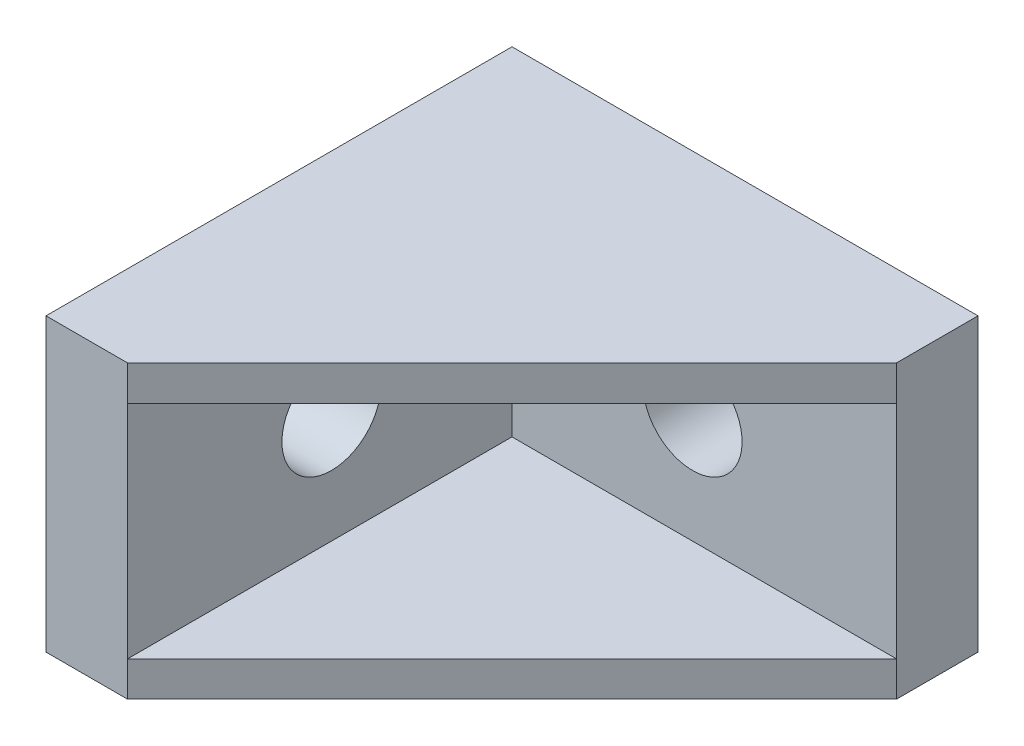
ISO-10303-21;
HEADER;
FILE_DESCRIPTION(('STEP AP214'),'2;1');
FILE_NAME('part.step','',(''),(''),'','','');
FILE_SCHEMA(('AUTOMOTIVE_DESIGN { 1 0 10303 214 1 1 1 1 }'));
ENDSEC;
DATA;
#1=APPLICATION_CONTEXT('core data for automotive mechanical design processes');
#2=APPLICATION_PROTOCOL_DEFINITION('international standard','automotive_design',2000,#1);
#3=PRODUCT_CONTEXT('',#1,'mechanical');
#4=PRODUCT('Part','Part','',(#3));
#5=PRODUCT_RELATED_PRODUCT_CATEGORY('part','',(#4));
#6=PRODUCT_DEFINITION_FORMATION('','',#4);
#7=PRODUCT_DEFINITION_CONTEXT('part definition',#1,'design');
#8=PRODUCT_DEFINITION('design','',#6,#7);
#9=PRODUCT_DEFINITION_SHAPE('','',#8);
#10=(LENGTH_UNIT() NAMED_UNIT(*) SI_UNIT(.MILLI.,.METRE.));
#11=(NAMED_UNIT(*) PLANE_ANGLE_UNIT() SI_UNIT($,.RADIAN.));
#12=(NAMED_UNIT(*) SI_UNIT($,.STERADIAN.) SOLID_ANGLE_UNIT());
#13=UNCERTAINTY_MEASURE_WITH_UNIT(LENGTH_MEASURE(1.E-05),#10,'distance_accuracy_value','');
#14=(GEOMETRIC_REPRESENTATION_CONTEXT(3) GLOBAL_UNCERTAINTY_ASSIGNED_CONTEXT((#13)) GLOBAL_UNIT_ASSIGNED_CONTEXT((#10,
#11,#12)) REPRESENTATION_CONTEXT('',''));
#15=CARTESIAN_POINT('',(0.,0.,0.));
#16=DIRECTION('',(0.,0.,1.));
#17=DIRECTION('',(1.,0.,0.));
#18=AXIS2_PLACEMENT_3D('',#15,#16,#17);
#19=CARTESIAN_POINT('',(15.6482371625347,-9.5,15.6482371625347));
#20=DIRECTION('',(0.,-1.,0.));
#21=DIRECTION('',(0.,0.,-1.));
#22=AXIS2_PLACEMENT_3D('',#19,#20,#21);
#23=PLANE('',#22);
#24=DIRECTION('',(0.707106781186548,0.,-0.707106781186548));
#25=VECTOR('',#24,1.);
#26=CARTESIAN_POINT('',(7.,-9.5,40.));
#27=LINE('',#26,#25);
#28=CARTESIAN_POINT('',(40.,-9.5,7.));
#29=VERTEX_POINT('',#28);
#30=CARTESIAN_POINT('',(7.,-9.5,40.));
#31=VERTEX_POINT('',#30);
#32=EDGE_CURVE('E101',#29,#31,#27,.F.);
#33=ORIENTED_EDGE('',*,*,#32,.F.);
#34=DIRECTION('',(-1.,0.,0.));
#35=VECTOR('',#34,1.);
#36=CARTESIAN_POINT('',(20.,-9.5,7.));
#37=LINE('',#36,#35);
#38=CARTESIAN_POINT('',(7.,-9.5,7.));
#39=VERTEX_POINT('',#38);
#40=EDGE_CURVE('E96',#29,#39,#37,.T.);
#41=ORIENTED_EDGE('',*,*,#40,.T.);
#42=DIRECTION('',(0.,0.,1.));
#43=VECTOR('',#42,1.);
#44=CARTESIAN_POINT('',(7.,-9.5,20.));
#45=LINE('',#44,#43);
#46=EDGE_CURVE('E83',#39,#31,#45,.T.);
#47=ORIENTED_EDGE('',*,*,#46,.T.);
#48=EDGE_LOOP('',(#33,#41,#47));
#49=FACE_BOUND('',#48,.T.);
#50=ADVANCED_FACE('F15',(#49),#23,.F.);
#51=CARTESIAN_POINT('',(7.,0.,20.));
#52=DIRECTION('',(-1.,0.,0.));
#53=DIRECTION('',(0.,0.,1.));
#54=AXIS2_PLACEMENT_3D('',#51,#52,#53);
#55=PLANE('',#54);
#56=CARTESIAN_POINT('',(7.,0.,22.5));
#57=DIRECTION('',(-1.,0.,0.));
#58=DIRECTION('',(0.,-1.,0.));
#59=AXIS2_PLACEMENT_3D('',#56,#57,#58);
#60=CIRCLE('',#59,4.25);
#61=CARTESIAN_POINT('',(7.,-4.25,22.5));
#62=VERTEX_POINT('',#61);
#63=EDGE_CURVE('E18',#62,#62,#60,.T.);
#64=ORIENTED_EDGE('',*,*,#63,.T.);
#65=EDGE_LOOP('',(#64));
#66=FACE_BOUND('',#65,.T.);
#67=DIRECTION('',(0.,1.,0.));
#68=VECTOR('',#67,1.);
#69=CARTESIAN_POINT('',(7.,0.,7.));
#70=LINE('',#69,#68);
#71=CARTESIAN_POINT('',(7.,9.5,7.));
#72=VERTEX_POINT('',#71);
#73=EDGE_CURVE('E86',#39,#72,#70,.T.);
#74=ORIENTED_EDGE('',*,*,#73,.T.);
#75=DIRECTION('',(0.,0.,-1.));
#76=VECTOR('',#75,1.);
#77=CARTESIAN_POINT('',(7.,9.5,15.6482371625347));
#78=LINE('',#77,#76);
#79=CARTESIAN_POINT('',(7.,9.5,40.));
#80=VERTEX_POINT('',#79);
#81=EDGE_CURVE('E77',#80,#72,#78,.T.);
#82=ORIENTED_EDGE('',*,*,#81,.F.);
#83=DIRECTION('',(0.,1.,0.));
#84=VECTOR('',#83,1.);
#85=CARTESIAN_POINT('',(7.,-9.5,40.));
#86=LINE('',#85,#84);
#87=EDGE_CURVE('E88',#31,#80,#86,.T.);
#88=ORIENTED_EDGE('',*,*,#87,.F.);
#89=ORIENTED_EDGE('',*,*,#46,.F.);
#90=EDGE_LOOP('',(#74,#82,#88,#89));
#91=FACE_BOUND('',#90,.T.);
#92=ADVANCED_FACE('F85',(#66,#91),#55,.F.);
#93=CARTESIAN_POINT('',(3.5,0.,22.5));
#94=DIRECTION('',(-1.,0.,0.));
#95=DIRECTION('',(0.,-1.,0.));
#96=AXIS2_PLACEMENT_3D('',#93,#94,#95);
#97=CYLINDRICAL_SURFACE('',#96,4.25);
#98=ORIENTED_EDGE('',*,*,#63,.F.);
#99=EDGE_LOOP('',(#98));
#100=FACE_BOUND('',#99,.T.);
#101=CARTESIAN_POINT('',(0.,0.,22.5));
#102=DIRECTION('',(-1.,0.,0.));
#103=DIRECTION('',(0.,-1.,0.));
#104=AXIS2_PLACEMENT_3D('',#101,#102,#103);
#105=CIRCLE('',#104,4.25);
#106=CARTESIAN_POINT('',(0.,-4.25,22.5));
#107=VERTEX_POINT('',#106);
#108=EDGE_CURVE('E112',#107,#107,#105,.F.);
#109=ORIENTED_EDGE('',*,*,#108,.F.);
#110=EDGE_LOOP('',(#109));
#111=FACE_BOUND('',#110,.T.);
#112=ADVANCED_FACE('F217',(#100,#111),#97,.F.);
#113=CARTESIAN_POINT('',(22.5,0.,3.5));
#114=DIRECTION('',(0.,0.,-1.));
#115=DIRECTION('',(0.,1.,0.));
#116=AXIS2_PLACEMENT_3D('',#113,#114,#115);
#117=CYLINDRICAL_SURFACE('',#116,4.25);
#118=CARTESIAN_POINT('',(22.5,0.,7.));
#119=DIRECTION('',(0.,0.,-1.));
#120=DIRECTION('',(0.,1.,0.));
#121=AXIS2_PLACEMENT_3D('',#118,#119,#120);
#122=CIRCLE('',#121,4.25);
#123=CARTESIAN_POINT('',(22.5,4.25,7.));
#124=VERTEX_POINT('',#123);
#125=EDGE_CURVE('E99',#124,#124,#122,.F.);
#126=ORIENTED_EDGE('',*,*,#125,.T.);
#127=EDGE_LOOP('',(#126));
#128=FACE_BOUND('',#127,.T.);
#129=CARTESIAN_POINT('',(22.5,0.,0.));
#130=DIRECTION('',(0.,0.,-1.));
#131=DIRECTION('',(0.,1.,0.));
#132=AXIS2_PLACEMENT_3D('',#129,#130,#131);
#133=CIRCLE('',#132,4.25);
#134=CARTESIAN_POINT('',(22.5,4.25,0.));
#135=VERTEX_POINT('',#134);
#136=EDGE_CURVE('E107',#135,#135,#133,.F.);
#137=ORIENTED_EDGE('',*,*,#136,.F.);
#138=EDGE_LOOP('',(#137));
#139=FACE_BOUND('',#138,.T.);
#140=ADVANCED_FACE('F213',(#128,#139),#117,.F.);
#141=CARTESIAN_POINT('',(15.6482371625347,-12.5,15.6482371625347));
#142=DIRECTION('',(0.,-1.,0.));
#143=DIRECTION('',(0.,0.,-1.));
#144=AXIS2_PLACEMENT_3D('',#141,#142,#143);
#145=PLANE('',#144);
#146=DIRECTION('',(1.,0.,0.));
#147=VECTOR('',#146,1.);
#148=CARTESIAN_POINT('',(0.,-12.5,40.));
#149=LINE('',#148,#147);
#150=CARTESIAN_POINT('',(0.,-12.5,40.));
#151=VERTEX_POINT('',#150);
#152=CARTESIAN_POINT('',(7.,-12.5,40.));
#153=VERTEX_POINT('',#152);
#154=EDGE_CURVE('E128',#151,#153,#149,.T.);
#155=ORIENTED_EDGE('',*,*,#154,.F.);
#156=DIRECTION('',(0.,0.,1.));
#157=VECTOR('',#156,1.);
#158=CARTESIAN_POINT('',(0.,-12.5,0.));
#159=LINE('',#158,#157);
#160=CARTESIAN_POINT('',(0.,-12.5,0.));
#161=VERTEX_POINT('',#160);
#162=EDGE_CURVE('E115',#161,#151,#159,.T.);
#163=ORIENTED_EDGE('',*,*,#162,.F.);
#164=DIRECTION('',(-1.,0.,0.));
#165=VECTOR('',#164,1.);
#166=CARTESIAN_POINT('',(40.,-12.5,0.));
#167=LINE('',#166,#165);
#168=CARTESIAN_POINT('',(40.,-12.5,0.));
#169=VERTEX_POINT('',#168);
#170=EDGE_CURVE('E114',#169,#161,#167,.T.);
#171=ORIENTED_EDGE('',*,*,#170,.F.);
#172=DIRECTION('',(0.,0.,-1.));
#173=VECTOR('',#172,1.);
#174=CARTESIAN_POINT('',(40.,-12.5,7.));
#175=LINE('',#174,#173);
#176=CARTESIAN_POINT('',(40.,-12.5,7.));
#177=VERTEX_POINT('',#176);
#178=EDGE_CURVE('E110',#177,#169,#175,.T.);
#179=ORIENTED_EDGE('',*,*,#178,.F.);
#180=DIRECTION('',(0.707106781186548,0.,-0.707106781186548));
#181=VECTOR('',#180,1.);
#182=CARTESIAN_POINT('',(7.,-12.5,40.));
#183=LINE('',#182,#181);
#184=EDGE_CURVE('E117',#153,#177,#183,.T.);
#185=ORIENTED_EDGE('',*,*,#184,.F.);
#186=EDGE_LOOP('',(#155,#163,#171,#179,#185));
#187=FACE_BOUND('',#186,.T.);
#188=ADVANCED_FACE('F209',(#187),#145,.T.);
#189=CARTESIAN_POINT('',(20.,0.,7.));
#190=DIRECTION('',(0.,0.,-1.));
#191=DIRECTION('',(-1.,0.,0.));
#192=AXIS2_PLACEMENT_3D('',#189,#190,#191);
#193=PLANE('',#192);
#194=ORIENTED_EDGE('',*,*,#125,.F.);
#195=EDGE_LOOP('',(#194));
#196=FACE_BOUND('',#195,.T.);
#197=ORIENTED_EDGE('',*,*,#40,.F.);
#198=DIRECTION('',(0.,1.,0.));
#199=VECTOR('',#198,1.);
#200=CARTESIAN_POINT('',(40.,-9.5,7.));
#201=LINE('',#200,#199);
#202=CARTESIAN_POINT('',(40.,9.5,7.));
#203=VERTEX_POINT('',#202);
#204=EDGE_CURVE('E143',#203,#29,#201,.F.);
#205=ORIENTED_EDGE('',*,*,#204,.F.);
#206=DIRECTION('',(1.,0.,0.));
#207=VECTOR('',#206,1.);
#208=CARTESIAN_POINT('',(15.6482371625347,9.5,7.));
#209=LINE('',#208,#207);
#210=EDGE_CURVE('E98',#72,#203,#209,.T.);
#211=ORIENTED_EDGE('',*,*,#210,.F.);
#212=ORIENTED_EDGE('',*,*,#73,.F.);
#213=EDGE_LOOP('',(#197,#205,#211,#212));
#214=FACE_BOUND('',#213,.T.);
#215=ADVANCED_FACE('F94',(#196,#214),#193,.F.);
#216=CARTESIAN_POINT('',(7.,-9.5,40.));
#217=DIRECTION('',(0.707106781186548,0.,0.707106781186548));
#218=DIRECTION('',(0.707106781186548,0.,-0.707106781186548));
#219=AXIS2_PLACEMENT_3D('',#216,#217,#218);
#220=PLANE('',#219);
#221=ORIENTED_EDGE('',*,*,#32,.T.);
#222=DIRECTION('',(0.,1.,0.));
#223=VECTOR('',#222,1.);
#224=CARTESIAN_POINT('',(7.,-9.5,40.));
#225=LINE('',#224,#223);
#226=EDGE_CURVE('E130',#153,#31,#225,.T.);
#227=ORIENTED_EDGE('',*,*,#226,.F.);
#228=ORIENTED_EDGE('',*,*,#184,.T.);
#229=DIRECTION('',(0.,1.,0.));
#230=VECTOR('',#229,1.);
#231=CARTESIAN_POINT('',(40.,-9.5,7.));
#232=LINE('',#231,#230);
#233=EDGE_CURVE('E145',#29,#177,#232,.F.);
#234=ORIENTED_EDGE('',*,*,#233,.F.);
#235=EDGE_LOOP('',(#221,#227,#228,#234));
#236=FACE_BOUND('',#235,.T.);
#237=ADVANCED_FACE('F204',(#236),#220,.T.);
#238=CARTESIAN_POINT('',(15.6482371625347,9.5,15.6482371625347));
#239=DIRECTION('',(0.,-1.,0.));
#240=DIRECTION('',(0.,0.,-1.));
#241=AXIS2_PLACEMENT_3D('',#238,#239,#240);
#242=PLANE('',#241);
#243=ORIENTED_EDGE('',*,*,#210,.T.);
#244=DIRECTION('',(0.707106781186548,0.,-0.707106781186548));
#245=VECTOR('',#244,1.);
#246=CARTESIAN_POINT('',(7.,9.5,40.));
#247=LINE('',#246,#245);
#248=EDGE_CURVE('E147',#80,#203,#247,.T.);
#249=ORIENTED_EDGE('',*,*,#248,.F.);
#250=ORIENTED_EDGE('',*,*,#81,.T.);
#251=EDGE_LOOP('',(#243,#249,#250));
#252=FACE_BOUND('',#251,.T.);
#253=ADVANCED_FACE('F201',(#252),#242,.T.);
#254=CARTESIAN_POINT('',(0.,-9.5,40.));
#255=DIRECTION('',(0.,0.,1.));
#256=DIRECTION('',(1.,0.,0.));
#257=AXIS2_PLACEMENT_3D('',#254,#255,#256);
#258=PLANE('',#257);
#259=DIRECTION('',(1.,0.,0.));
#260=VECTOR('',#259,1.);
#261=CARTESIAN_POINT('',(15.6482371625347,12.5,40.));
#262=LINE('',#261,#260);
#263=CARTESIAN_POINT('',(7.,12.5,40.));
#264=VERTEX_POINT('',#263);
#265=CARTESIAN_POINT('',(0.,12.5,40.));
#266=VERTEX_POINT('',#265);
#267=EDGE_CURVE('E153',#264,#266,#262,.F.);
#268=ORIENTED_EDGE('',*,*,#267,.T.);
#269=DIRECTION('',(0.,1.,0.));
#270=VECTOR('',#269,1.);
#271=CARTESIAN_POINT('',(0.,-9.5,40.));
#272=LINE('',#271,#270);
#273=EDGE_CURVE('E134',#151,#266,#272,.T.);
#274=ORIENTED_EDGE('',*,*,#273,.F.);
#275=ORIENTED_EDGE('',*,*,#154,.T.);
#276=ORIENTED_EDGE('',*,*,#226,.T.);
#277=ORIENTED_EDGE('',*,*,#87,.T.);
#278=DIRECTION('',(0.,1.,0.));
#279=VECTOR('',#278,1.);
#280=CARTESIAN_POINT('',(7.,12.5,40.));
#281=LINE('',#280,#279);
#282=EDGE_CURVE('E150',#264,#80,#281,.F.);
#283=ORIENTED_EDGE('',*,*,#282,.F.);
#284=EDGE_LOOP('',(#268,#274,#275,#276,#277,#283));
#285=FACE_BOUND('',#284,.T.);
#286=ADVANCED_FACE('F181',(#285),#258,.T.);
#287=CARTESIAN_POINT('',(0.,-9.5,0.));
#288=DIRECTION('',(-1.,0.,0.));
#289=DIRECTION('',(0.,0.,1.));
#290=AXIS2_PLACEMENT_3D('',#287,#288,#289);
#291=PLANE('',#290);
#292=ORIENTED_EDGE('',*,*,#108,.T.);
#293=EDGE_LOOP('',(#292));
#294=FACE_BOUND('',#293,.T.);
#295=DIRECTION('',(0.,1.,0.));
#296=VECTOR('',#295,1.);
#297=CARTESIAN_POINT('',(0.,-9.5,0.));
#298=LINE('',#297,#296);
#299=CARTESIAN_POINT('',(0.,12.5,0.));
#300=VERTEX_POINT('',#299);
#301=EDGE_CURVE('E111',#161,#300,#298,.T.);
#302=ORIENTED_EDGE('',*,*,#301,.F.);
#303=ORIENTED_EDGE('',*,*,#162,.T.);
#304=ORIENTED_EDGE('',*,*,#273,.T.);
#305=DIRECTION('',(0.,0.,-1.));
#306=VECTOR('',#305,1.);
#307=CARTESIAN_POINT('',(0.,12.5,15.6482371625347));
#308=LINE('',#307,#306);
#309=EDGE_CURVE('E156',#266,#300,#308,.T.);
#310=ORIENTED_EDGE('',*,*,#309,.T.);
#311=EDGE_LOOP('',(#302,#303,#304,#310));
#312=FACE_BOUND('',#311,.T.);
#313=ADVANCED_FACE('F177',(#294,#312),#291,.T.);
#314=CARTESIAN_POINT('',(40.,-9.5,0.));
#315=DIRECTION('',(0.,0.,-1.));
#316=DIRECTION('',(-1.,0.,0.));
#317=AXIS2_PLACEMENT_3D('',#314,#315,#316);
#318=PLANE('',#317);
#319=ORIENTED_EDGE('',*,*,#136,.T.);
#320=EDGE_LOOP('',(#319));
#321=FACE_BOUND('',#320,.T.);
#322=ORIENTED_EDGE('',*,*,#170,.T.);
#323=ORIENTED_EDGE('',*,*,#301,.T.);
#324=DIRECTION('',(1.,0.,0.));
#325=VECTOR('',#324,1.);
#326=CARTESIAN_POINT('',(15.6482371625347,12.5,0.));
#327=LINE('',#326,#325);
#328=CARTESIAN_POINT('',(40.,12.5,0.));
#329=VERTEX_POINT('',#328);
#330=EDGE_CURVE('E159',#300,#329,#327,.T.);
#331=ORIENTED_EDGE('',*,*,#330,.T.);
#332=DIRECTION('',(0.,1.,0.));
#333=VECTOR('',#332,1.);
#334=CARTESIAN_POINT('',(40.,-9.5,0.));
#335=LINE('',#334,#333);
#336=EDGE_CURVE('E141',#169,#329,#335,.T.);
#337=ORIENTED_EDGE('',*,*,#336,.F.);
#338=EDGE_LOOP('',(#322,#323,#331,#337));
#339=FACE_BOUND('',#338,.T.);
#340=ADVANCED_FACE('F172',(#321,#339),#318,.T.);
#341=CARTESIAN_POINT('',(40.,-9.5,7.));
#342=DIRECTION('',(1.,0.,0.));
#343=DIRECTION('',(0.,0.,-1.));
#344=AXIS2_PLACEMENT_3D('',#341,#342,#343);
#345=PLANE('',#344);
#346=ORIENTED_EDGE('',*,*,#204,.T.);
#347=ORIENTED_EDGE('',*,*,#233,.T.);
#348=ORIENTED_EDGE('',*,*,#178,.T.);
#349=ORIENTED_EDGE('',*,*,#336,.T.);
#350=DIRECTION('',(0.,0.,-1.));
#351=VECTOR('',#350,1.);
#352=CARTESIAN_POINT('',(40.,12.5,15.6482371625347));
#353=LINE('',#352,#351);
#354=CARTESIAN_POINT('',(40.,12.5,7.));
#355=VERTEX_POINT('',#354);
#356=EDGE_CURVE('E24',#329,#355,#353,.F.);
#357=ORIENTED_EDGE('',*,*,#356,.T.);
#358=DIRECTION('',(0.,1.,0.));
#359=VECTOR('',#358,1.);
#360=CARTESIAN_POINT('',(40.,12.5,6.99999999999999));
#361=LINE('',#360,#359);
#362=EDGE_CURVE('E32',#203,#355,#361,.T.);
#363=ORIENTED_EDGE('',*,*,#362,.F.);
#364=EDGE_LOOP('',(#346,#347,#348,#349,#357,#363));
#365=FACE_BOUND('',#364,.T.);
#366=ADVANCED_FACE('F165',(#365),#345,.T.);
#367=CARTESIAN_POINT('',(7.,12.5,40.));
#368=DIRECTION('',(0.707106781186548,0.,0.707106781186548));
#369=DIRECTION('',(0.707106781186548,0.,-0.707106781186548));
#370=AXIS2_PLACEMENT_3D('',#367,#368,#369);
#371=PLANE('',#370);
#372=DIRECTION('',(-0.707106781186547,0.,0.707106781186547));
#373=VECTOR('',#372,1.);
#374=CARTESIAN_POINT('',(40.,12.5,7.));
#375=LINE('',#374,#373);
#376=EDGE_CURVE('E10',#355,#264,#375,.T.);
#377=ORIENTED_EDGE('',*,*,#376,.T.);
#378=ORIENTED_EDGE('',*,*,#282,.T.);
#379=ORIENTED_EDGE('',*,*,#248,.T.);
#380=ORIENTED_EDGE('',*,*,#362,.T.);
#381=EDGE_LOOP('',(#377,#378,#379,#380));
#382=FACE_BOUND('',#381,.T.);
#383=ADVANCED_FACE('F182',(#382),#371,.T.);
#384=CARTESIAN_POINT('',(15.6482371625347,12.5,15.6482371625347));
#385=DIRECTION('',(0.,-1.,0.));
#386=DIRECTION('',(0.,0.,-1.));
#387=AXIS2_PLACEMENT_3D('',#384,#385,#386);
#388=PLANE('',#387);
#389=ORIENTED_EDGE('',*,*,#356,.F.);
#390=ORIENTED_EDGE('',*,*,#330,.F.);
#391=ORIENTED_EDGE('',*,*,#309,.F.);
#392=ORIENTED_EDGE('',*,*,#267,.F.);
#393=ORIENTED_EDGE('',*,*,#376,.F.);
#394=EDGE_LOOP('',(#389,#390,#391,#392,#393));
#395=FACE_BOUND('',#394,.T.);
#396=ADVANCED_FACE('F169',(#395),#388,.F.);
#397=CLOSED_SHELL('',(#50,#92,#112,#140,#188,#215,#237,#253,#286,#313,#340,#366,#383,#396));
#398=MANIFOLD_SOLID_BREP('B1',#397);
#399=ADVANCED_BREP_SHAPE_REPRESENTATION('',(#18,#398),#14);
#400=SHAPE_DEFINITION_REPRESENTATION(#9,#399);
ENDSEC;
END-ISO-10303-21;
